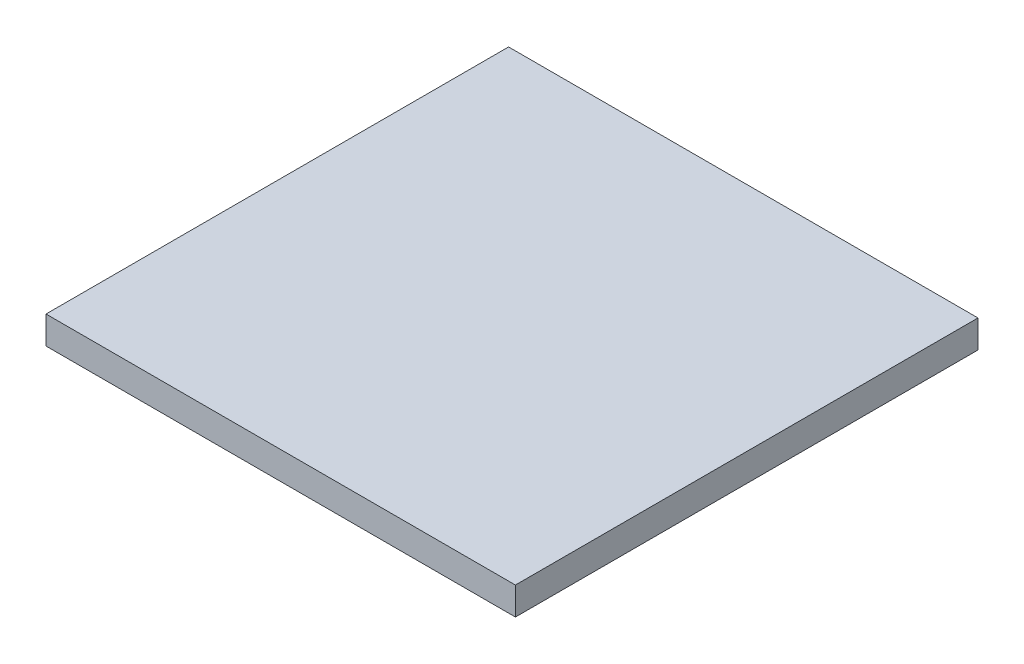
ISO-10303-21;
HEADER;
FILE_DESCRIPTION(('STEP AP214'),'2;1');
FILE_NAME('part.step','',(''),(''),'','','');
FILE_SCHEMA(('AUTOMOTIVE_DESIGN { 1 0 10303 214 1 1 1 1 }'));
ENDSEC;
DATA;
#1=APPLICATION_CONTEXT('core data for automotive mechanical design processes');
#2=APPLICATION_PROTOCOL_DEFINITION('international standard','automotive_design',2000,#1);
#3=PRODUCT_CONTEXT('',#1,'mechanical');
#4=PRODUCT('Part','Part','',(#3));
#5=PRODUCT_RELATED_PRODUCT_CATEGORY('part','',(#4));
#6=PRODUCT_DEFINITION_FORMATION('','',#4);
#7=PRODUCT_DEFINITION_CONTEXT('part definition',#1,'design');
#8=PRODUCT_DEFINITION('design','',#6,#7);
#9=PRODUCT_DEFINITION_SHAPE('','',#8);
#10=(LENGTH_UNIT() NAMED_UNIT(*) SI_UNIT(.MILLI.,.METRE.));
#11=(NAMED_UNIT(*) PLANE_ANGLE_UNIT() SI_UNIT($,.RADIAN.));
#12=(NAMED_UNIT(*) SI_UNIT($,.STERADIAN.) SOLID_ANGLE_UNIT());
#13=UNCERTAINTY_MEASURE_WITH_UNIT(LENGTH_MEASURE(1.E-05),#10,'distance_accuracy_value','');
#14=(GEOMETRIC_REPRESENTATION_CONTEXT(3) GLOBAL_UNCERTAINTY_ASSIGNED_CONTEXT((#13)) GLOBAL_UNIT_ASSIGNED_CONTEXT((#10,
#11,#12)) REPRESENTATION_CONTEXT('',''));
#15=CARTESIAN_POINT('',(0.,0.,0.));
#16=DIRECTION('',(0.,0.,1.));
#17=DIRECTION('',(1.,0.,0.));
#18=AXIS2_PLACEMENT_3D('',#15,#16,#17);
#19=CARTESIAN_POINT('',(101.475,12.,-100.));
#20=DIRECTION('',(-1.,0.,0.));
#21=DIRECTION('',(0.,0.,1.));
#22=AXIS2_PLACEMENT_3D('',#19,#20,#21);
#23=PLANE('',#22);
#24=DIRECTION('',(0.,0.,-1.));
#25=VECTOR('',#24,1.);
#26=CARTESIAN_POINT('',(101.475,0.,-100.));
#27=LINE('',#26,#25);
#28=CARTESIAN_POINT('',(101.475,0.,100.));
#29=VERTEX_POINT('',#28);
#30=CARTESIAN_POINT('',(101.475,0.,-100.));
#31=VERTEX_POINT('',#30);
#32=EDGE_CURVE('E96',#29,#31,#27,.T.);
#33=ORIENTED_EDGE('',*,*,#32,.T.);
#34=DIRECTION('',(0.,-1.,0.));
#35=VECTOR('',#34,1.);
#36=CARTESIAN_POINT('',(101.475,12.,-100.));
#37=LINE('',#36,#35);
#38=CARTESIAN_POINT('',(101.475,12.,-100.));
#39=VERTEX_POINT('',#38);
#40=EDGE_CURVE('E11',#39,#31,#37,.T.);
#41=ORIENTED_EDGE('',*,*,#40,.F.);
#42=DIRECTION('',(0.,0.,-1.));
#43=VECTOR('',#42,1.);
#44=CARTESIAN_POINT('',(101.475,12.,-100.));
#45=LINE('',#44,#43);
#46=CARTESIAN_POINT('',(101.475,12.,100.));
#47=VERTEX_POINT('',#46);
#48=EDGE_CURVE('E84',#47,#39,#45,.T.);
#49=ORIENTED_EDGE('',*,*,#48,.F.);
#50=DIRECTION('',(0.,-1.,0.));
#51=VECTOR('',#50,1.);
#52=CARTESIAN_POINT('',(101.475,12.,100.));
#53=LINE('',#52,#51);
#54=EDGE_CURVE('E92',#47,#29,#53,.T.);
#55=ORIENTED_EDGE('',*,*,#54,.T.);
#56=EDGE_LOOP('',(#33,#41,#49,#55));
#57=FACE_BOUND('',#56,.T.);
#58=ADVANCED_FACE('F33',(#57),#23,.F.);
#59=CARTESIAN_POINT('',(-101.475,12.,-100.));
#60=DIRECTION('',(0.,0.,1.));
#61=DIRECTION('',(1.,0.,0.));
#62=AXIS2_PLACEMENT_3D('',#59,#60,#61);
#63=PLANE('',#62);
#64=DIRECTION('',(-1.,0.,0.));
#65=VECTOR('',#64,1.);
#66=CARTESIAN_POINT('',(-101.475,0.,-100.));
#67=LINE('',#66,#65);
#68=CARTESIAN_POINT('',(-101.475,0.,-100.));
#69=VERTEX_POINT('',#68);
#70=EDGE_CURVE('E88',#31,#69,#67,.T.);
#71=ORIENTED_EDGE('',*,*,#70,.T.);
#72=DIRECTION('',(0.,-1.,0.));
#73=VECTOR('',#72,1.);
#74=CARTESIAN_POINT('',(-101.475,12.,-100.));
#75=LINE('',#74,#73);
#76=CARTESIAN_POINT('',(-101.475,12.,-100.));
#77=VERTEX_POINT('',#76);
#78=EDGE_CURVE('E41',#77,#69,#75,.T.);
#79=ORIENTED_EDGE('',*,*,#78,.F.);
#80=DIRECTION('',(-1.,0.,0.));
#81=VECTOR('',#80,1.);
#82=CARTESIAN_POINT('',(-101.475,12.,-100.));
#83=LINE('',#82,#81);
#84=EDGE_CURVE('E79',#39,#77,#83,.T.);
#85=ORIENTED_EDGE('',*,*,#84,.F.);
#86=ORIENTED_EDGE('',*,*,#40,.T.);
#87=EDGE_LOOP('',(#71,#79,#85,#86));
#88=FACE_BOUND('',#87,.T.);
#89=ADVANCED_FACE('F87',(#88),#63,.F.);
#90=CARTESIAN_POINT('',(-101.475,12.,-100.));
#91=DIRECTION('',(1.,0.,0.));
#92=DIRECTION('',(0.,0.,-1.));
#93=AXIS2_PLACEMENT_3D('',#90,#91,#92);
#94=PLANE('',#93);
#95=DIRECTION('',(0.,0.,1.));
#96=VECTOR('',#95,1.);
#97=CARTESIAN_POINT('',(-101.475,0.,-100.));
#98=LINE('',#97,#96);
#99=CARTESIAN_POINT('',(-101.475,0.,100.));
#100=VERTEX_POINT('',#99);
#101=EDGE_CURVE('E66',#69,#100,#98,.T.);
#102=ORIENTED_EDGE('',*,*,#101,.T.);
#103=DIRECTION('',(0.,-1.,0.));
#104=VECTOR('',#103,1.);
#105=CARTESIAN_POINT('',(-101.475,12.,100.));
#106=LINE('',#105,#104);
#107=CARTESIAN_POINT('',(-101.475,12.,100.));
#108=VERTEX_POINT('',#107);
#109=EDGE_CURVE('E89',#108,#100,#106,.T.);
#110=ORIENTED_EDGE('',*,*,#109,.F.);
#111=DIRECTION('',(0.,0.,1.));
#112=VECTOR('',#111,1.);
#113=CARTESIAN_POINT('',(-101.475,12.,-100.));
#114=LINE('',#113,#112);
#115=EDGE_CURVE('E82',#77,#108,#114,.T.);
#116=ORIENTED_EDGE('',*,*,#115,.F.);
#117=ORIENTED_EDGE('',*,*,#78,.T.);
#118=EDGE_LOOP('',(#102,#110,#116,#117));
#119=FACE_BOUND('',#118,.T.);
#120=ADVANCED_FACE('F90',(#119),#94,.F.);
#121=CARTESIAN_POINT('',(-101.475,12.,100.));
#122=DIRECTION('',(0.,0.,-1.));
#123=DIRECTION('',(-1.,0.,0.));
#124=AXIS2_PLACEMENT_3D('',#121,#122,#123);
#125=PLANE('',#124);
#126=DIRECTION('',(1.,0.,0.));
#127=VECTOR('',#126,1.);
#128=CARTESIAN_POINT('',(-101.475,0.,100.));
#129=LINE('',#128,#127);
#130=EDGE_CURVE('E72',#100,#29,#129,.T.);
#131=ORIENTED_EDGE('',*,*,#130,.T.);
#132=ORIENTED_EDGE('',*,*,#54,.F.);
#133=DIRECTION('',(1.,0.,0.));
#134=VECTOR('',#133,1.);
#135=CARTESIAN_POINT('',(-101.475,12.,100.));
#136=LINE('',#135,#134);
#137=EDGE_CURVE('E49',#108,#47,#136,.T.);
#138=ORIENTED_EDGE('',*,*,#137,.F.);
#139=ORIENTED_EDGE('',*,*,#109,.T.);
#140=EDGE_LOOP('',(#131,#132,#138,#139));
#141=FACE_BOUND('',#140,.T.);
#142=ADVANCED_FACE('F103',(#141),#125,.F.);
#143=CARTESIAN_POINT('',(0.,12.,0.));
#144=DIRECTION('',(0.,1.,0.));
#145=DIRECTION('',(0.,0.,1.));
#146=AXIS2_PLACEMENT_3D('',#143,#144,#145);
#147=PLANE('',#146);
#148=ORIENTED_EDGE('',*,*,#48,.T.);
#149=ORIENTED_EDGE('',*,*,#84,.T.);
#150=ORIENTED_EDGE('',*,*,#115,.T.);
#151=ORIENTED_EDGE('',*,*,#137,.T.);
#152=EDGE_LOOP('',(#148,#149,#150,#151));
#153=FACE_BOUND('',#152,.T.);
#154=ADVANCED_FACE('F80',(#153),#147,.T.);
#155=CARTESIAN_POINT('',(0.,0.,0.));
#156=DIRECTION('',(0.,1.,0.));
#157=DIRECTION('',(0.,0.,1.));
#158=AXIS2_PLACEMENT_3D('',#155,#156,#157);
#159=PLANE('',#158);
#160=ORIENTED_EDGE('',*,*,#32,.F.);
#161=ORIENTED_EDGE('',*,*,#130,.F.);
#162=ORIENTED_EDGE('',*,*,#101,.F.);
#163=ORIENTED_EDGE('',*,*,#70,.F.);
#164=EDGE_LOOP('',(#160,#161,#162,#163));
#165=FACE_BOUND('',#164,.T.);
#166=ADVANCED_FACE('F106',(#165),#159,.F.);
#167=CLOSED_SHELL('',(#58,#89,#120,#142,#154,#166));
#168=MANIFOLD_SOLID_BREP('B2',#167);
#169=ADVANCED_BREP_SHAPE_REPRESENTATION('',(#18,#168),#14);
#170=SHAPE_DEFINITION_REPRESENTATION(#9,#169);
ENDSEC;
END-ISO-10303-21;
